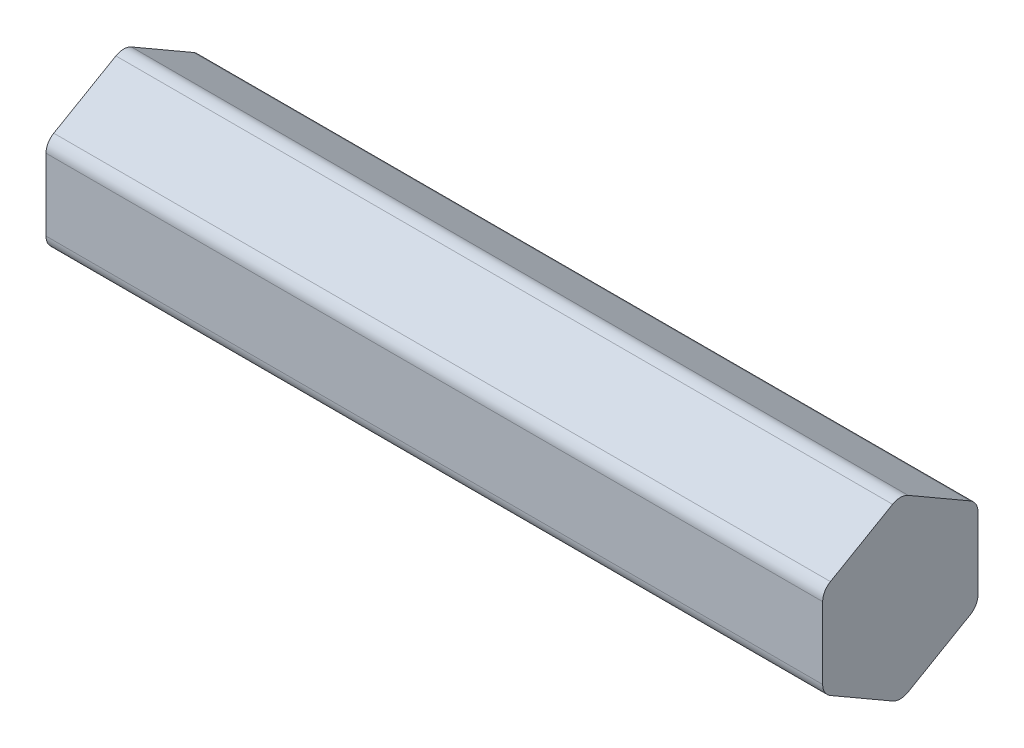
ISO-10303-21;
HEADER;
FILE_DESCRIPTION(('STEP AP214'),'2;1');
FILE_NAME('part.step','',(''),(''),'','','');
FILE_SCHEMA(('AUTOMOTIVE_DESIGN { 1 0 10303 214 1 1 1 1 }'));
ENDSEC;
DATA;
#1=APPLICATION_CONTEXT('core data for automotive mechanical design processes');
#2=APPLICATION_PROTOCOL_DEFINITION('international standard','automotive_design',2000,#1);
#3=PRODUCT_CONTEXT('',#1,'mechanical');
#4=PRODUCT('Part','Part','',(#3));
#5=PRODUCT_RELATED_PRODUCT_CATEGORY('part','',(#4));
#6=PRODUCT_DEFINITION_FORMATION('','',#4);
#7=PRODUCT_DEFINITION_CONTEXT('part definition',#1,'design');
#8=PRODUCT_DEFINITION('design','',#6,#7);
#9=PRODUCT_DEFINITION_SHAPE('','',#8);
#10=(LENGTH_UNIT() NAMED_UNIT(*) SI_UNIT(.MILLI.,.METRE.));
#11=(NAMED_UNIT(*) PLANE_ANGLE_UNIT() SI_UNIT($,.RADIAN.));
#12=(NAMED_UNIT(*) SI_UNIT($,.STERADIAN.) SOLID_ANGLE_UNIT());
#13=UNCERTAINTY_MEASURE_WITH_UNIT(LENGTH_MEASURE(1.E-05),#10,'distance_accuracy_value','');
#14=(GEOMETRIC_REPRESENTATION_CONTEXT(3) GLOBAL_UNCERTAINTY_ASSIGNED_CONTEXT((#13)) GLOBAL_UNIT_ASSIGNED_CONTEXT((#10,
#11,#12)) REPRESENTATION_CONTEXT('',''));
#15=CARTESIAN_POINT('',(0.,0.,0.));
#16=DIRECTION('',(0.,0.,1.));
#17=DIRECTION('',(1.,0.,0.));
#18=AXIS2_PLACEMENT_3D('',#15,#16,#17);
#19=CARTESIAN_POINT('',(50.,2.88675134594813,-5.));
#20=DIRECTION('',(0.,-0.866025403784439,0.5));
#21=DIRECTION('',(0.,-0.5,-0.866025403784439));
#22=AXIS2_PLACEMENT_3D('',#19,#20,#21);
#23=PLANE('',#22);
#24=DIRECTION('',(0.,0.5,0.866025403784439));
#25=VECTOR('',#24,1.);
#26=CARTESIAN_POINT('',(50.,2.88675134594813,-5.));
#27=LINE('',#26,#25);
#28=CARTESIAN_POINT('',(50.,3.17542648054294,-4.5));
#29=VERTEX_POINT('',#28);
#30=CARTESIAN_POINT('',(50.,5.48482755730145,-0.5));
#31=VERTEX_POINT('',#30);
#32=EDGE_CURVE('E147',#29,#31,#27,.T.);
#33=ORIENTED_EDGE('',*,*,#32,.F.);
#34=DIRECTION('',(-1.,0.,0.));
#35=VECTOR('',#34,1.);
#36=CARTESIAN_POINT('',(50.,3.17542648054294,-4.5));
#37=LINE('',#36,#35);
#38=CARTESIAN_POINT('',(0.,3.17542648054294,-4.5));
#39=VERTEX_POINT('',#38);
#40=EDGE_CURVE('E132',#29,#39,#37,.T.);
#41=ORIENTED_EDGE('',*,*,#40,.T.);
#42=DIRECTION('',(0.,0.5,0.866025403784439));
#43=VECTOR('',#42,1.);
#44=CARTESIAN_POINT('',(0.,2.88675134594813,-5.));
#45=LINE('',#44,#43);
#46=CARTESIAN_POINT('',(0.,5.48482755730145,-0.5));
#47=VERTEX_POINT('',#46);
#48=EDGE_CURVE('E143',#39,#47,#45,.T.);
#49=ORIENTED_EDGE('',*,*,#48,.T.);
#50=DIRECTION('',(-1.,0.,0.));
#51=VECTOR('',#50,1.);
#52=CARTESIAN_POINT('',(50.,5.48482755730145,-0.499999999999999));
#53=LINE('',#52,#51);
#54=EDGE_CURVE('E149',#47,#31,#53,.F.);
#55=ORIENTED_EDGE('',*,*,#54,.T.);
#56=EDGE_LOOP('',(#33,#41,#49,#55));
#57=FACE_BOUND('',#56,.T.);
#58=ADVANCED_FACE('F39',(#57),#23,.F.);
#59=CARTESIAN_POINT('',(50.,5.77350269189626,0.));
#60=DIRECTION('',(0.,-0.866025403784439,-0.5));
#61=DIRECTION('',(0.,0.5,-0.866025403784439));
#62=AXIS2_PLACEMENT_3D('',#59,#60,#61);
#63=PLANE('',#62);
#64=DIRECTION('',(0.,-0.5,0.866025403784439));
#65=VECTOR('',#64,1.);
#66=CARTESIAN_POINT('',(0.,5.77350269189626,0.));
#67=LINE('',#66,#65);
#68=CARTESIAN_POINT('',(0.,5.48482755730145,0.500000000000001));
#69=VERTEX_POINT('',#68);
#70=CARTESIAN_POINT('',(0.,3.17542648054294,4.5));
#71=VERTEX_POINT('',#70);
#72=EDGE_CURVE('E153',#69,#71,#67,.T.);
#73=ORIENTED_EDGE('',*,*,#72,.T.);
#74=DIRECTION('',(-1.,0.,0.));
#75=VECTOR('',#74,1.);
#76=CARTESIAN_POINT('',(50.,3.17542648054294,4.5));
#77=LINE('',#76,#75);
#78=CARTESIAN_POINT('',(50.,3.17542648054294,4.5));
#79=VERTEX_POINT('',#78);
#80=EDGE_CURVE('E11',#71,#79,#77,.F.);
#81=ORIENTED_EDGE('',*,*,#80,.T.);
#82=DIRECTION('',(0.,-0.5,0.866025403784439));
#83=VECTOR('',#82,1.);
#84=CARTESIAN_POINT('',(50.,5.77350269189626,0.));
#85=LINE('',#84,#83);
#86=CARTESIAN_POINT('',(50.,5.48482755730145,0.500000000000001));
#87=VERTEX_POINT('',#86);
#88=EDGE_CURVE('E214',#87,#79,#85,.T.);
#89=ORIENTED_EDGE('',*,*,#88,.F.);
#90=DIRECTION('',(-1.,0.,0.));
#91=VECTOR('',#90,1.);
#92=CARTESIAN_POINT('',(50.,5.48482755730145,0.500000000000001));
#93=LINE('',#92,#91);
#94=EDGE_CURVE('E50',#87,#69,#93,.T.);
#95=ORIENTED_EDGE('',*,*,#94,.T.);
#96=EDGE_LOOP('',(#73,#81,#89,#95));
#97=FACE_BOUND('',#96,.T.);
#98=ADVANCED_FACE('F215',(#97),#63,.F.);
#99=CARTESIAN_POINT('',(50.,2.88675134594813,5.));
#100=DIRECTION('',(0.,0.,-1.));
#101=DIRECTION('',(-1.,0.,0.));
#102=AXIS2_PLACEMENT_3D('',#99,#100,#101);
#103=PLANE('',#102);
#104=DIRECTION('',(0.,-1.,0.));
#105=VECTOR('',#104,1.);
#106=CARTESIAN_POINT('',(0.,2.88675134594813,5.));
#107=LINE('',#106,#105);
#108=CARTESIAN_POINT('',(0.,2.3094010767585,5.));
#109=VERTEX_POINT('',#108);
#110=CARTESIAN_POINT('',(0.,-2.3094010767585,5.));
#111=VERTEX_POINT('',#110);
#112=EDGE_CURVE('E160',#109,#111,#107,.T.);
#113=ORIENTED_EDGE('',*,*,#112,.T.);
#114=DIRECTION('',(-1.,0.,0.));
#115=VECTOR('',#114,1.);
#116=CARTESIAN_POINT('',(50.,-2.3094010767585,5.));
#117=LINE('',#116,#115);
#118=CARTESIAN_POINT('',(50.,-2.3094010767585,5.));
#119=VERTEX_POINT('',#118);
#120=EDGE_CURVE('E210',#111,#119,#117,.F.);
#121=ORIENTED_EDGE('',*,*,#120,.T.);
#122=DIRECTION('',(0.,-1.,0.));
#123=VECTOR('',#122,1.);
#124=CARTESIAN_POINT('',(50.,2.88675134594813,5.));
#125=LINE('',#124,#123);
#126=CARTESIAN_POINT('',(50.,2.3094010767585,5.));
#127=VERTEX_POINT('',#126);
#128=EDGE_CURVE('E226',#127,#119,#125,.T.);
#129=ORIENTED_EDGE('',*,*,#128,.F.);
#130=DIRECTION('',(-1.,0.,0.));
#131=VECTOR('',#130,1.);
#132=CARTESIAN_POINT('',(50.,2.3094010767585,5.));
#133=LINE('',#132,#131);
#134=EDGE_CURVE('E202',#127,#109,#133,.T.);
#135=ORIENTED_EDGE('',*,*,#134,.T.);
#136=EDGE_LOOP('',(#113,#121,#129,#135));
#137=FACE_BOUND('',#136,.T.);
#138=ADVANCED_FACE('F224',(#137),#103,.F.);
#139=CARTESIAN_POINT('',(50.,-2.88675134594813,5.));
#140=DIRECTION('',(0.,0.866025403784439,-0.5));
#141=DIRECTION('',(0.,0.5,0.866025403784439));
#142=AXIS2_PLACEMENT_3D('',#139,#140,#141);
#143=PLANE('',#142);
#144=DIRECTION('',(0.,-0.5,-0.866025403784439));
#145=VECTOR('',#144,1.);
#146=CARTESIAN_POINT('',(0.,-2.88675134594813,5.));
#147=LINE('',#146,#145);
#148=CARTESIAN_POINT('',(0.,-3.17542648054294,4.5));
#149=VERTEX_POINT('',#148);
#150=CARTESIAN_POINT('',(0.,-5.48482755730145,0.5));
#151=VERTEX_POINT('',#150);
#152=EDGE_CURVE('E164',#149,#151,#147,.T.);
#153=ORIENTED_EDGE('',*,*,#152,.T.);
#154=DIRECTION('',(-1.,0.,0.));
#155=VECTOR('',#154,1.);
#156=CARTESIAN_POINT('',(50.,-5.48482755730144,0.500000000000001));
#157=LINE('',#156,#155);
#158=CARTESIAN_POINT('',(50.,-5.48482755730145,0.5));
#159=VERTEX_POINT('',#158);
#160=EDGE_CURVE('E205',#151,#159,#157,.F.);
#161=ORIENTED_EDGE('',*,*,#160,.T.);
#162=DIRECTION('',(0.,-0.5,-0.866025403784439));
#163=VECTOR('',#162,1.);
#164=CARTESIAN_POINT('',(50.,-2.88675134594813,5.));
#165=LINE('',#164,#163);
#166=CARTESIAN_POINT('',(50.,-3.17542648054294,4.5));
#167=VERTEX_POINT('',#166);
#168=EDGE_CURVE('E229',#167,#159,#165,.T.);
#169=ORIENTED_EDGE('',*,*,#168,.F.);
#170=DIRECTION('',(-1.,0.,0.));
#171=VECTOR('',#170,1.);
#172=CARTESIAN_POINT('',(50.,-3.17542648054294,4.5));
#173=LINE('',#172,#171);
#174=EDGE_CURVE('E198',#167,#149,#173,.T.);
#175=ORIENTED_EDGE('',*,*,#174,.T.);
#176=EDGE_LOOP('',(#153,#161,#169,#175));
#177=FACE_BOUND('',#176,.T.);
#178=ADVANCED_FACE('F254',(#177),#143,.F.);
#179=CARTESIAN_POINT('',(50.,-5.77350269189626,0.));
#180=DIRECTION('',(0.,0.866025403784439,0.5));
#181=DIRECTION('',(0.,-0.5,0.866025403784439));
#182=AXIS2_PLACEMENT_3D('',#179,#180,#181);
#183=PLANE('',#182);
#184=DIRECTION('',(0.,0.5,-0.866025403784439));
#185=VECTOR('',#184,1.);
#186=CARTESIAN_POINT('',(0.,-5.77350269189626,0.));
#187=LINE('',#186,#185);
#188=CARTESIAN_POINT('',(0.,-5.48482755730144,-0.499999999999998));
#189=VERTEX_POINT('',#188);
#190=CARTESIAN_POINT('',(0.,-3.17542648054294,-4.5));
#191=VERTEX_POINT('',#190);
#192=EDGE_CURVE('E166',#189,#191,#187,.T.);
#193=ORIENTED_EDGE('',*,*,#192,.T.);
#194=DIRECTION('',(-1.,0.,0.));
#195=VECTOR('',#194,1.);
#196=CARTESIAN_POINT('',(50.,-3.17542648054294,-4.5));
#197=LINE('',#196,#195);
#198=CARTESIAN_POINT('',(50.,-3.17542648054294,-4.5));
#199=VERTEX_POINT('',#198);
#200=EDGE_CURVE('E53',#191,#199,#197,.F.);
#201=ORIENTED_EDGE('',*,*,#200,.T.);
#202=DIRECTION('',(0.,0.5,-0.866025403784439));
#203=VECTOR('',#202,1.);
#204=CARTESIAN_POINT('',(50.,-5.77350269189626,0.));
#205=LINE('',#204,#203);
#206=CARTESIAN_POINT('',(50.,-5.48482755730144,-0.499999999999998));
#207=VERTEX_POINT('',#206);
#208=EDGE_CURVE('E235',#207,#199,#205,.T.);
#209=ORIENTED_EDGE('',*,*,#208,.F.);
#210=DIRECTION('',(-1.,0.,0.));
#211=VECTOR('',#210,1.);
#212=CARTESIAN_POINT('',(50.,-5.48482755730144,-0.499999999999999));
#213=LINE('',#212,#211);
#214=EDGE_CURVE('E194',#207,#189,#213,.T.);
#215=ORIENTED_EDGE('',*,*,#214,.T.);
#216=EDGE_LOOP('',(#193,#201,#209,#215));
#217=FACE_BOUND('',#216,.T.);
#218=ADVANCED_FACE('F246',(#217),#183,.F.);
#219=CARTESIAN_POINT('',(50.,-2.88675134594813,-5.));
#220=DIRECTION('',(0.,0.,1.));
#221=DIRECTION('',(0.,-1.,0.));
#222=AXIS2_PLACEMENT_3D('',#219,#220,#221);
#223=PLANE('',#222);
#224=DIRECTION('',(0.,1.,0.));
#225=VECTOR('',#224,1.);
#226=CARTESIAN_POINT('',(0.,-2.88675134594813,-5.));
#227=LINE('',#226,#225);
#228=CARTESIAN_POINT('',(0.,-2.3094010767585,-5.));
#229=VERTEX_POINT('',#228);
#230=CARTESIAN_POINT('',(0.,2.3094010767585,-5.));
#231=VERTEX_POINT('',#230);
#232=EDGE_CURVE('E167',#229,#231,#227,.T.);
#233=ORIENTED_EDGE('',*,*,#232,.T.);
#234=DIRECTION('',(-1.,0.,0.));
#235=VECTOR('',#234,1.);
#236=CARTESIAN_POINT('',(50.,2.3094010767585,-5.));
#237=LINE('',#236,#235);
#238=CARTESIAN_POINT('',(50.,2.3094010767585,-5.));
#239=VERTEX_POINT('',#238);
#240=EDGE_CURVE('E133',#231,#239,#237,.F.);
#241=ORIENTED_EDGE('',*,*,#240,.T.);
#242=DIRECTION('',(0.,1.,0.));
#243=VECTOR('',#242,1.);
#244=CARTESIAN_POINT('',(50.,-2.88675134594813,-5.));
#245=LINE('',#244,#243);
#246=CARTESIAN_POINT('',(50.,-2.3094010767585,-5.));
#247=VERTEX_POINT('',#246);
#248=EDGE_CURVE('E159',#247,#239,#245,.T.);
#249=ORIENTED_EDGE('',*,*,#248,.F.);
#250=DIRECTION('',(-1.,0.,0.));
#251=VECTOR('',#250,1.);
#252=CARTESIAN_POINT('',(50.,-2.3094010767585,-5.));
#253=LINE('',#252,#251);
#254=EDGE_CURVE('E137',#247,#229,#253,.T.);
#255=ORIENTED_EDGE('',*,*,#254,.T.);
#256=EDGE_LOOP('',(#233,#241,#249,#255));
#257=FACE_BOUND('',#256,.T.);
#258=ADVANCED_FACE('F245',(#257),#223,.F.);
#259=CARTESIAN_POINT('',(50.,5.77350269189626,0.));
#260=DIRECTION('',(1.,0.,0.));
#261=DIRECTION('',(0.,0.,-1.));
#262=AXIS2_PLACEMENT_3D('',#259,#260,#261);
#263=PLANE('',#262);
#264=ORIENTED_EDGE('',*,*,#248,.T.);
#265=CARTESIAN_POINT('',(50.,2.3094010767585,-4.));
#266=DIRECTION('',(1.,0.,0.));
#267=DIRECTION('',(0.,0.,-1.));
#268=AXIS2_PLACEMENT_3D('',#265,#266,#267);
#269=CIRCLE('',#268,1.);
#270=EDGE_CURVE('E192',#239,#29,#269,.T.);
#271=ORIENTED_EDGE('',*,*,#270,.T.);
#272=ORIENTED_EDGE('',*,*,#32,.T.);
#273=CARTESIAN_POINT('',(50.,4.61880215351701,0.));
#274=DIRECTION('',(1.,0.,0.));
#275=DIRECTION('',(0.,0.,-1.));
#276=AXIS2_PLACEMENT_3D('',#273,#274,#275);
#277=CIRCLE('',#276,1.);
#278=EDGE_CURVE('E183',#31,#87,#277,.T.);
#279=ORIENTED_EDGE('',*,*,#278,.T.);
#280=ORIENTED_EDGE('',*,*,#88,.T.);
#281=CARTESIAN_POINT('',(50.,2.3094010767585,4.));
#282=DIRECTION('',(1.,0.,0.));
#283=DIRECTION('',(0.,0.,-1.));
#284=AXIS2_PLACEMENT_3D('',#281,#282,#283);
#285=CIRCLE('',#284,1.);
#286=EDGE_CURVE('E187',#79,#127,#285,.T.);
#287=ORIENTED_EDGE('',*,*,#286,.T.);
#288=ORIENTED_EDGE('',*,*,#128,.T.);
#289=CARTESIAN_POINT('',(50.,-2.3094010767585,4.));
#290=DIRECTION('',(1.,0.,0.));
#291=DIRECTION('',(0.,0.,-1.));
#292=AXIS2_PLACEMENT_3D('',#289,#290,#291);
#293=CIRCLE('',#292,1.);
#294=EDGE_CURVE('E189',#119,#167,#293,.T.);
#295=ORIENTED_EDGE('',*,*,#294,.T.);
#296=ORIENTED_EDGE('',*,*,#168,.T.);
#297=CARTESIAN_POINT('',(50.,-4.61880215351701,0.));
#298=DIRECTION('',(1.,0.,0.));
#299=DIRECTION('',(0.,0.,-1.));
#300=AXIS2_PLACEMENT_3D('',#297,#298,#299);
#301=CIRCLE('',#300,1.);
#302=EDGE_CURVE('E61',#159,#207,#301,.T.);
#303=ORIENTED_EDGE('',*,*,#302,.T.);
#304=ORIENTED_EDGE('',*,*,#208,.T.);
#305=CARTESIAN_POINT('',(50.,-2.3094010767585,-4.));
#306=DIRECTION('',(1.,0.,0.));
#307=DIRECTION('',(0.,0.,-1.));
#308=AXIS2_PLACEMENT_3D('',#305,#306,#307);
#309=CIRCLE('',#308,1.);
#310=EDGE_CURVE('E191',#199,#247,#309,.T.);
#311=ORIENTED_EDGE('',*,*,#310,.T.);
#312=EDGE_LOOP('',(#264,#271,#272,#279,#280,#287,#288,#295,#296,#303,#304,#311));
#313=FACE_BOUND('',#312,.T.);
#314=ADVANCED_FACE('F237',(#313),#263,.T.);
#315=CARTESIAN_POINT('',(0.,5.77350269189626,0.));
#316=DIRECTION('',(1.,0.,0.));
#317=DIRECTION('',(0.,0.,-1.));
#318=AXIS2_PLACEMENT_3D('',#315,#316,#317);
#319=PLANE('',#318);
#320=ORIENTED_EDGE('',*,*,#48,.F.);
#321=CARTESIAN_POINT('',(0.,2.3094010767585,-4.));
#322=DIRECTION('',(1.,0.,0.));
#323=DIRECTION('',(0.,0.,-1.));
#324=AXIS2_PLACEMENT_3D('',#321,#322,#323);
#325=CIRCLE('',#324,1.);
#326=EDGE_CURVE('E128',#39,#231,#325,.F.);
#327=ORIENTED_EDGE('',*,*,#326,.T.);
#328=ORIENTED_EDGE('',*,*,#232,.F.);
#329=CARTESIAN_POINT('',(0.,-2.3094010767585,-4.));
#330=DIRECTION('',(1.,0.,0.));
#331=DIRECTION('',(0.,0.,-1.));
#332=AXIS2_PLACEMENT_3D('',#329,#330,#331);
#333=CIRCLE('',#332,1.);
#334=EDGE_CURVE('E139',#229,#191,#333,.F.);
#335=ORIENTED_EDGE('',*,*,#334,.T.);
#336=ORIENTED_EDGE('',*,*,#192,.F.);
#337=CARTESIAN_POINT('',(0.,-4.61880215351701,0.));
#338=DIRECTION('',(1.,0.,0.));
#339=DIRECTION('',(0.,0.,-1.));
#340=AXIS2_PLACEMENT_3D('',#337,#338,#339);
#341=CIRCLE('',#340,1.);
#342=EDGE_CURVE('E178',#189,#151,#341,.F.);
#343=ORIENTED_EDGE('',*,*,#342,.T.);
#344=ORIENTED_EDGE('',*,*,#152,.F.);
#345=CARTESIAN_POINT('',(0.,-2.3094010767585,4.));
#346=DIRECTION('',(1.,0.,0.));
#347=DIRECTION('',(0.,0.,-1.));
#348=AXIS2_PLACEMENT_3D('',#345,#346,#347);
#349=CIRCLE('',#348,1.);
#350=EDGE_CURVE('E176',#149,#111,#349,.F.);
#351=ORIENTED_EDGE('',*,*,#350,.T.);
#352=ORIENTED_EDGE('',*,*,#112,.F.);
#353=CARTESIAN_POINT('',(0.,2.3094010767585,4.));
#354=DIRECTION('',(1.,0.,0.));
#355=DIRECTION('',(0.,0.,-1.));
#356=AXIS2_PLACEMENT_3D('',#353,#354,#355);
#357=CIRCLE('',#356,1.);
#358=EDGE_CURVE('E172',#109,#71,#357,.F.);
#359=ORIENTED_EDGE('',*,*,#358,.T.);
#360=ORIENTED_EDGE('',*,*,#72,.F.);
#361=CARTESIAN_POINT('',(0.,4.61880215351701,0.));
#362=DIRECTION('',(1.,0.,0.));
#363=DIRECTION('',(0.,0.,-1.));
#364=AXIS2_PLACEMENT_3D('',#361,#362,#363);
#365=CIRCLE('',#364,1.);
#366=EDGE_CURVE('E148',#69,#47,#365,.F.);
#367=ORIENTED_EDGE('',*,*,#366,.T.);
#368=EDGE_LOOP('',(#320,#327,#328,#335,#336,#343,#344,#351,#352,#359,#360,#367));
#369=FACE_BOUND('',#368,.T.);
#370=ADVANCED_FACE('F155',(#369),#319,.F.);
#371=CARTESIAN_POINT('',(50.,2.3094010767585,-4.));
#372=DIRECTION('',(-1.,0.,0.));
#373=DIRECTION('',(0.,0.,1.));
#374=AXIS2_PLACEMENT_3D('',#371,#372,#373);
#375=CYLINDRICAL_SURFACE('',#374,1.);
#376=ORIENTED_EDGE('',*,*,#270,.F.);
#377=ORIENTED_EDGE('',*,*,#240,.F.);
#378=ORIENTED_EDGE('',*,*,#326,.F.);
#379=ORIENTED_EDGE('',*,*,#40,.F.);
#380=EDGE_LOOP('',(#376,#377,#378,#379));
#381=FACE_BOUND('',#380,.T.);
#382=ADVANCED_FACE('F135',(#381),#375,.T.);
#383=CARTESIAN_POINT('',(50.,-2.3094010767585,-4.));
#384=DIRECTION('',(-1.,0.,0.));
#385=DIRECTION('',(0.,0.,1.));
#386=AXIS2_PLACEMENT_3D('',#383,#384,#385);
#387=CYLINDRICAL_SURFACE('',#386,1.);
#388=ORIENTED_EDGE('',*,*,#310,.F.);
#389=ORIENTED_EDGE('',*,*,#200,.F.);
#390=ORIENTED_EDGE('',*,*,#334,.F.);
#391=ORIENTED_EDGE('',*,*,#254,.F.);
#392=EDGE_LOOP('',(#388,#389,#390,#391));
#393=FACE_BOUND('',#392,.T.);
#394=ADVANCED_FACE('F242',(#393),#387,.T.);
#395=CARTESIAN_POINT('',(50.,-4.61880215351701,0.));
#396=DIRECTION('',(-1.,0.,0.));
#397=DIRECTION('',(0.,0.,1.));
#398=AXIS2_PLACEMENT_3D('',#395,#396,#397);
#399=CYLINDRICAL_SURFACE('',#398,1.);
#400=ORIENTED_EDGE('',*,*,#302,.F.);
#401=ORIENTED_EDGE('',*,*,#160,.F.);
#402=ORIENTED_EDGE('',*,*,#342,.F.);
#403=ORIENTED_EDGE('',*,*,#214,.F.);
#404=EDGE_LOOP('',(#400,#401,#402,#403));
#405=FACE_BOUND('',#404,.T.);
#406=ADVANCED_FACE('F248',(#405),#399,.T.);
#407=CARTESIAN_POINT('',(50.,-2.3094010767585,4.));
#408=DIRECTION('',(-1.,0.,0.));
#409=DIRECTION('',(0.,0.,1.));
#410=AXIS2_PLACEMENT_3D('',#407,#408,#409);
#411=CYLINDRICAL_SURFACE('',#410,1.);
#412=ORIENTED_EDGE('',*,*,#294,.F.);
#413=ORIENTED_EDGE('',*,*,#120,.F.);
#414=ORIENTED_EDGE('',*,*,#350,.F.);
#415=ORIENTED_EDGE('',*,*,#174,.F.);
#416=EDGE_LOOP('',(#412,#413,#414,#415));
#417=FACE_BOUND('',#416,.T.);
#418=ADVANCED_FACE('F260',(#417),#411,.T.);
#419=CARTESIAN_POINT('',(50.,2.3094010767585,4.));
#420=DIRECTION('',(-1.,0.,0.));
#421=DIRECTION('',(0.,0.,1.));
#422=AXIS2_PLACEMENT_3D('',#419,#420,#421);
#423=CYLINDRICAL_SURFACE('',#422,1.);
#424=ORIENTED_EDGE('',*,*,#286,.F.);
#425=ORIENTED_EDGE('',*,*,#80,.F.);
#426=ORIENTED_EDGE('',*,*,#358,.F.);
#427=ORIENTED_EDGE('',*,*,#134,.F.);
#428=EDGE_LOOP('',(#424,#425,#426,#427));
#429=FACE_BOUND('',#428,.T.);
#430=ADVANCED_FACE('F225',(#429),#423,.T.);
#431=CARTESIAN_POINT('',(50.,4.61880215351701,0.));
#432=DIRECTION('',(-1.,0.,0.));
#433=DIRECTION('',(0.,0.,1.));
#434=AXIS2_PLACEMENT_3D('',#431,#432,#433);
#435=CYLINDRICAL_SURFACE('',#434,1.);
#436=ORIENTED_EDGE('',*,*,#278,.F.);
#437=ORIENTED_EDGE('',*,*,#54,.F.);
#438=ORIENTED_EDGE('',*,*,#366,.F.);
#439=ORIENTED_EDGE('',*,*,#94,.F.);
#440=EDGE_LOOP('',(#436,#437,#438,#439));
#441=FACE_BOUND('',#440,.T.);
#442=ADVANCED_FACE('F41',(#441),#435,.T.);
#443=CLOSED_SHELL('',(#58,#98,#138,#178,#218,#258,#314,#370,#382,#394,#406,#418,#430,#442));
#444=MANIFOLD_SOLID_BREP('B2',#443);
#445=ADVANCED_BREP_SHAPE_REPRESENTATION('',(#18,#444),#14);
#446=SHAPE_DEFINITION_REPRESENTATION(#9,#445);
ENDSEC;
END-ISO-10303-21;
